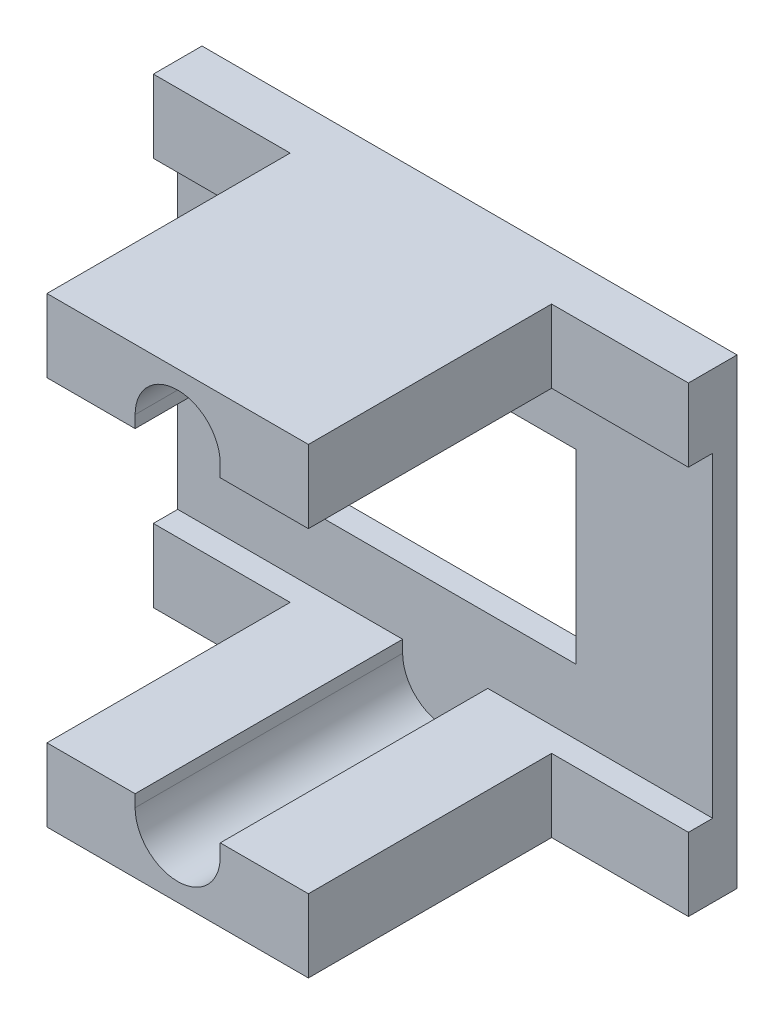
ISO-10303-21;
HEADER;
FILE_DESCRIPTION(('STEP AP214'),'2;1');
FILE_NAME('part.step','',(''),(''),'','','');
FILE_SCHEMA(('AUTOMOTIVE_DESIGN { 1 0 10303 214 1 1 1 1 }'));
ENDSEC;
DATA;
#1=APPLICATION_CONTEXT('core data for automotive mechanical design processes');
#2=APPLICATION_PROTOCOL_DEFINITION('international standard','automotive_design',2000,#1);
#3=PRODUCT_CONTEXT('',#1,'mechanical');
#4=PRODUCT('Part','Part','',(#3));
#5=PRODUCT_RELATED_PRODUCT_CATEGORY('part','',(#4));
#6=PRODUCT_DEFINITION_FORMATION('','',#4);
#7=PRODUCT_DEFINITION_CONTEXT('part definition',#1,'design');
#8=PRODUCT_DEFINITION('design','',#6,#7);
#9=PRODUCT_DEFINITION_SHAPE('','',#8);
#10=(LENGTH_UNIT() NAMED_UNIT(*) SI_UNIT(.MILLI.,.METRE.));
#11=(NAMED_UNIT(*) PLANE_ANGLE_UNIT() SI_UNIT($,.RADIAN.));
#12=(NAMED_UNIT(*) SI_UNIT($,.STERADIAN.) SOLID_ANGLE_UNIT());
#13=UNCERTAINTY_MEASURE_WITH_UNIT(LENGTH_MEASURE(1.E-05),#10,'distance_accuracy_value','');
#14=(GEOMETRIC_REPRESENTATION_CONTEXT(3) GLOBAL_UNCERTAINTY_ASSIGNED_CONTEXT((#13)) GLOBAL_UNIT_ASSIGNED_CONTEXT((#10,
#11,#12)) REPRESENTATION_CONTEXT('',''));
#15=CARTESIAN_POINT('',(0.,0.,0.));
#16=DIRECTION('',(0.,0.,1.));
#17=DIRECTION('',(1.,0.,0.));
#18=AXIS2_PLACEMENT_3D('',#15,#16,#17);
#19=CARTESIAN_POINT('',(-16.375,16.,12.));
#20=DIRECTION('',(0.,1.,0.));
#21=DIRECTION('',(0.,0.,1.));
#22=AXIS2_PLACEMENT_3D('',#19,#20,#21);
#23=PLANE('',#22);
#24=DIRECTION('',(0.,0.,1.));
#25=VECTOR('',#24,1.);
#26=CARTESIAN_POINT('',(-9.24999999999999,16.,12.));
#27=LINE('',#26,#25);
#28=CARTESIAN_POINT('',(-9.24999999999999,16.,1.));
#29=VERTEX_POINT('',#28);
#30=CARTESIAN_POINT('',(-9.24999999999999,16.,12.));
#31=VERTEX_POINT('',#30);
#32=EDGE_CURVE('E249',#29,#31,#27,.T.);
#33=ORIENTED_EDGE('',*,*,#32,.F.);
#34=DIRECTION('',(-1.,0.,0.));
#35=VECTOR('',#34,1.);
#36=CARTESIAN_POINT('',(-22.,16.,1.));
#37=LINE('',#36,#35);
#38=CARTESIAN_POINT('',(0.,16.,1.));
#39=VERTEX_POINT('',#38);
#40=EDGE_CURVE('E285',#39,#29,#37,.T.);
#41=ORIENTED_EDGE('',*,*,#40,.F.);
#42=DIRECTION('',(0.,0.,1.));
#43=VECTOR('',#42,1.);
#44=CARTESIAN_POINT('',(0.,16.,1.));
#45=LINE('',#44,#43);
#46=CARTESIAN_POINT('',(0.,16.,2.));
#47=VERTEX_POINT('',#46);
#48=EDGE_CURVE('E297',#39,#47,#45,.T.);
#49=ORIENTED_EDGE('',*,*,#48,.T.);
#50=DIRECTION('',(-1.,0.,0.));
#51=VECTOR('',#50,1.);
#52=CARTESIAN_POINT('',(-22.,16.,2.));
#53=LINE('',#52,#51);
#54=CARTESIAN_POINT('',(-5.625,16.,2.));
#55=VERTEX_POINT('',#54);
#56=EDGE_CURVE('E279',#47,#55,#53,.T.);
#57=ORIENTED_EDGE('',*,*,#56,.T.);
#58=DIRECTION('',(0.,0.,-1.));
#59=VECTOR('',#58,1.);
#60=CARTESIAN_POINT('',(-5.625,16.,12.));
#61=LINE('',#60,#59);
#62=CARTESIAN_POINT('',(-5.625,16.,12.));
#63=VERTEX_POINT('',#62);
#64=EDGE_CURVE('E365',#63,#55,#61,.T.);
#65=ORIENTED_EDGE('',*,*,#64,.F.);
#66=DIRECTION('',(1.,0.,0.));
#67=VECTOR('',#66,1.);
#68=CARTESIAN_POINT('',(-16.375,16.,12.));
#69=LINE('',#68,#67);
#70=EDGE_CURVE('E345',#31,#63,#69,.T.);
#71=ORIENTED_EDGE('',*,*,#70,.F.);
#72=EDGE_LOOP('',(#33,#41,#49,#57,#65,#71));
#73=FACE_BOUND('',#72,.T.);
#74=ADVANCED_FACE('F33',(#73),#23,.F.);
#75=CARTESIAN_POINT('',(0.,0.,12.));
#76=DIRECTION('',(0.,0.,1.));
#77=DIRECTION('',(1.,0.,0.));
#78=AXIS2_PLACEMENT_3D('',#75,#76,#77);
#79=PLANE('',#78);
#80=DIRECTION('',(0.,1.,0.));
#81=VECTOR('',#80,1.);
#82=CARTESIAN_POINT('',(-12.75,15.5,12.));
#83=LINE('',#82,#81);
#84=CARTESIAN_POINT('',(-12.75,16.,12.));
#85=VERTEX_POINT('',#84);
#86=CARTESIAN_POINT('',(-12.75,16.5,12.));
#87=VERTEX_POINT('',#86);
#88=EDGE_CURVE('E253',#85,#87,#83,.T.);
#89=ORIENTED_EDGE('',*,*,#88,.T.);
#90=CARTESIAN_POINT('',(-11.,16.5,12.));
#91=DIRECTION('',(0.,0.,1.));
#92=DIRECTION('',(1.,0.,0.));
#93=AXIS2_PLACEMENT_3D('',#90,#91,#92);
#94=CIRCLE('',#93,1.75);
#95=CARTESIAN_POINT('',(-9.24999999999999,16.5,12.));
#96=VERTEX_POINT('',#95);
#97=EDGE_CURVE('E256',#96,#87,#94,.T.);
#98=ORIENTED_EDGE('',*,*,#97,.F.);
#99=DIRECTION('',(0.,1.,0.));
#100=VECTOR('',#99,1.);
#101=CARTESIAN_POINT('',(-9.24999999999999,15.5,12.));
#102=LINE('',#101,#100);
#103=EDGE_CURVE('E255',#31,#96,#102,.T.);
#104=ORIENTED_EDGE('',*,*,#103,.F.);
#105=ORIENTED_EDGE('',*,*,#70,.T.);
#106=DIRECTION('',(0.,1.,0.));
#107=VECTOR('',#106,1.);
#108=CARTESIAN_POINT('',(-5.625,16.,12.));
#109=LINE('',#108,#107);
#110=CARTESIAN_POINT('',(-5.625,19.,12.));
#111=VERTEX_POINT('',#110);
#112=EDGE_CURVE('E344',#63,#111,#109,.T.);
#113=ORIENTED_EDGE('',*,*,#112,.T.);
#114=DIRECTION('',(-1.,0.,0.));
#115=VECTOR('',#114,1.);
#116=CARTESIAN_POINT('',(-16.375,19.,12.));
#117=LINE('',#116,#115);
#118=CARTESIAN_POINT('',(-16.375,19.,12.));
#119=VERTEX_POINT('',#118);
#120=EDGE_CURVE('E347',#111,#119,#117,.T.);
#121=ORIENTED_EDGE('',*,*,#120,.T.);
#122=DIRECTION('',(0.,-1.,0.));
#123=VECTOR('',#122,1.);
#124=CARTESIAN_POINT('',(-16.375,16.,12.));
#125=LINE('',#124,#123);
#126=CARTESIAN_POINT('',(-16.375,16.,12.));
#127=VERTEX_POINT('',#126);
#128=EDGE_CURVE('E349',#119,#127,#125,.T.);
#129=ORIENTED_EDGE('',*,*,#128,.T.);
#130=EDGE_CURVE('E341',#127,#85,#69,.T.);
#131=ORIENTED_EDGE('',*,*,#130,.T.);
#132=EDGE_LOOP('',(#89,#98,#104,#105,#113,#121,#129,#131));
#133=FACE_BOUND('',#132,.T.);
#134=ADVANCED_FACE('F472',(#133),#79,.T.);
#135=CARTESIAN_POINT('',(-16.375,3.,12.));
#136=DIRECTION('',(0.,-1.,0.));
#137=DIRECTION('',(0.,0.,-1.));
#138=AXIS2_PLACEMENT_3D('',#135,#136,#137);
#139=PLANE('',#138);
#140=DIRECTION('',(0.,0.,1.));
#141=VECTOR('',#140,1.);
#142=CARTESIAN_POINT('',(-12.75,3.,12.));
#143=LINE('',#142,#141);
#144=CARTESIAN_POINT('',(-12.75,3.,1.));
#145=VERTEX_POINT('',#144);
#146=CARTESIAN_POINT('',(-12.75,3.,12.));
#147=VERTEX_POINT('',#146);
#148=EDGE_CURVE('E272',#145,#147,#143,.T.);
#149=ORIENTED_EDGE('',*,*,#148,.F.);
#150=DIRECTION('',(1.,0.,0.));
#151=VECTOR('',#150,1.);
#152=CARTESIAN_POINT('',(-22.,3.,1.));
#153=LINE('',#152,#151);
#154=CARTESIAN_POINT('',(-22.,3.,1.));
#155=VERTEX_POINT('',#154);
#156=EDGE_CURVE('E280',#155,#145,#153,.T.);
#157=ORIENTED_EDGE('',*,*,#156,.F.);
#158=DIRECTION('',(0.,0.,1.));
#159=VECTOR('',#158,1.);
#160=CARTESIAN_POINT('',(-22.,3.,1.));
#161=LINE('',#160,#159);
#162=CARTESIAN_POINT('',(-22.,3.,2.));
#163=VERTEX_POINT('',#162);
#164=EDGE_CURVE('E288',#155,#163,#161,.T.);
#165=ORIENTED_EDGE('',*,*,#164,.T.);
#166=DIRECTION('',(1.,0.,0.));
#167=VECTOR('',#166,1.);
#168=CARTESIAN_POINT('',(-22.,3.,2.));
#169=LINE('',#168,#167);
#170=CARTESIAN_POINT('',(-16.375,3.,2.));
#171=VERTEX_POINT('',#170);
#172=EDGE_CURVE('E289',#163,#171,#169,.T.);
#173=ORIENTED_EDGE('',*,*,#172,.T.);
#174=DIRECTION('',(0.,0.,-1.));
#175=VECTOR('',#174,1.);
#176=CARTESIAN_POINT('',(-16.375,3.,12.));
#177=LINE('',#176,#175);
#178=CARTESIAN_POINT('',(-16.375,3.,12.));
#179=VERTEX_POINT('',#178);
#180=EDGE_CURVE('E324',#179,#171,#177,.T.);
#181=ORIENTED_EDGE('',*,*,#180,.F.);
#182=DIRECTION('',(-1.,0.,0.));
#183=VECTOR('',#182,1.);
#184=CARTESIAN_POINT('',(-16.375,3.,12.));
#185=LINE('',#184,#183);
#186=EDGE_CURVE('E320',#147,#179,#185,.T.);
#187=ORIENTED_EDGE('',*,*,#186,.F.);
#188=EDGE_LOOP('',(#149,#157,#165,#173,#181,#187));
#189=FACE_BOUND('',#188,.T.);
#190=ADVANCED_FACE('F452',(#189),#139,.F.);
#191=CARTESIAN_POINT('',(0.,0.,12.));
#192=DIRECTION('',(0.,0.,1.));
#193=DIRECTION('',(1.,0.,0.));
#194=AXIS2_PLACEMENT_3D('',#191,#192,#193);
#195=PLANE('',#194);
#196=CARTESIAN_POINT('',(-11.,2.5,12.));
#197=DIRECTION('',(0.,0.,1.));
#198=DIRECTION('',(1.,0.,0.));
#199=AXIS2_PLACEMENT_3D('',#196,#197,#198);
#200=CIRCLE('',#199,1.75);
#201=CARTESIAN_POINT('',(-12.75,2.5,12.));
#202=VERTEX_POINT('',#201);
#203=CARTESIAN_POINT('',(-9.25,2.5,12.));
#204=VERTEX_POINT('',#203);
#205=EDGE_CURVE('E56',#202,#204,#200,.T.);
#206=ORIENTED_EDGE('',*,*,#205,.F.);
#207=DIRECTION('',(0.,-1.,0.));
#208=VECTOR('',#207,1.);
#209=CARTESIAN_POINT('',(-12.75,0.,12.));
#210=LINE('',#209,#208);
#211=EDGE_CURVE('E226',#147,#202,#210,.T.);
#212=ORIENTED_EDGE('',*,*,#211,.F.);
#213=ORIENTED_EDGE('',*,*,#186,.T.);
#214=DIRECTION('',(0.,-1.,0.));
#215=VECTOR('',#214,1.);
#216=CARTESIAN_POINT('',(-16.375,3.,12.));
#217=LINE('',#216,#215);
#218=CARTESIAN_POINT('',(-16.375,0.,12.));
#219=VERTEX_POINT('',#218);
#220=EDGE_CURVE('E312',#179,#219,#217,.T.);
#221=ORIENTED_EDGE('',*,*,#220,.T.);
#222=DIRECTION('',(1.,0.,0.));
#223=VECTOR('',#222,1.);
#224=CARTESIAN_POINT('',(-16.375,0.,12.));
#225=LINE('',#224,#223);
#226=CARTESIAN_POINT('',(-5.625,0.,12.));
#227=VERTEX_POINT('',#226);
#228=EDGE_CURVE('E315',#219,#227,#225,.T.);
#229=ORIENTED_EDGE('',*,*,#228,.T.);
#230=DIRECTION('',(0.,1.,0.));
#231=VECTOR('',#230,1.);
#232=CARTESIAN_POINT('',(-5.625,3.,12.));
#233=LINE('',#232,#231);
#234=CARTESIAN_POINT('',(-5.625,3.,12.));
#235=VERTEX_POINT('',#234);
#236=EDGE_CURVE('E318',#227,#235,#233,.T.);
#237=ORIENTED_EDGE('',*,*,#236,.T.);
#238=CARTESIAN_POINT('',(-9.25,3.,12.));
#239=VERTEX_POINT('',#238);
#240=EDGE_CURVE('E321',#235,#239,#185,.T.);
#241=ORIENTED_EDGE('',*,*,#240,.T.);
#242=DIRECTION('',(0.,-1.,0.));
#243=VECTOR('',#242,1.);
#244=CARTESIAN_POINT('',(-9.25,0.,12.));
#245=LINE('',#244,#243);
#246=EDGE_CURVE('E227',#239,#204,#245,.T.);
#247=ORIENTED_EDGE('',*,*,#246,.T.);
#248=EDGE_LOOP('',(#206,#212,#213,#221,#229,#237,#241,#247));
#249=FACE_BOUND('',#248,.T.);
#250=ADVANCED_FACE('F502',(#249),#195,.T.);
#251=CARTESIAN_POINT('',(0.,0.,2.));
#252=DIRECTION('',(0.,0.,1.));
#253=DIRECTION('',(1.,0.,0.));
#254=AXIS2_PLACEMENT_3D('',#251,#252,#253);
#255=PLANE('',#254);
#256=ORIENTED_EDGE('',*,*,#56,.F.);
#257=DIRECTION('',(0.,1.,0.));
#258=VECTOR('',#257,1.);
#259=CARTESIAN_POINT('',(0.,0.,2.));
#260=LINE('',#259,#258);
#261=CARTESIAN_POINT('',(0.,19.,2.));
#262=VERTEX_POINT('',#261);
#263=EDGE_CURVE('E393',#47,#262,#260,.T.);
#264=ORIENTED_EDGE('',*,*,#263,.T.);
#265=DIRECTION('',(-1.,0.,0.));
#266=VECTOR('',#265,1.);
#267=CARTESIAN_POINT('',(0.,19.,2.));
#268=LINE('',#267,#266);
#269=CARTESIAN_POINT('',(-5.625,19.,2.));
#270=VERTEX_POINT('',#269);
#271=EDGE_CURVE('E394',#262,#270,#268,.T.);
#272=ORIENTED_EDGE('',*,*,#271,.T.);
#273=DIRECTION('',(0.,1.,0.));
#274=VECTOR('',#273,1.);
#275=CARTESIAN_POINT('',(-5.625,16.,2.));
#276=LINE('',#275,#274);
#277=EDGE_CURVE('E340',#55,#270,#276,.T.);
#278=ORIENTED_EDGE('',*,*,#277,.F.);
#279=EDGE_LOOP('',(#256,#264,#272,#278));
#280=FACE_BOUND('',#279,.T.);
#281=ADVANCED_FACE('F481',(#280),#255,.T.);
#282=CARTESIAN_POINT('',(-16.375,16.,2.));
#283=VERTEX_POINT('',#282);
#284=CARTESIAN_POINT('',(-22.,16.,2.));
#285=VERTEX_POINT('',#284);
#286=EDGE_CURVE('E291',#283,#285,#53,.T.);
#287=ORIENTED_EDGE('',*,*,#286,.F.);
#288=DIRECTION('',(0.,-1.,0.));
#289=VECTOR('',#288,1.);
#290=CARTESIAN_POINT('',(-16.375,16.,2.));
#291=LINE('',#290,#289);
#292=CARTESIAN_POINT('',(-16.375,19.,2.));
#293=VERTEX_POINT('',#292);
#294=EDGE_CURVE('E354',#293,#283,#291,.T.);
#295=ORIENTED_EDGE('',*,*,#294,.F.);
#296=CARTESIAN_POINT('',(-22.,19.,2.));
#297=VERTEX_POINT('',#296);
#298=EDGE_CURVE('E392',#293,#297,#268,.T.);
#299=ORIENTED_EDGE('',*,*,#298,.T.);
#300=DIRECTION('',(0.,-1.,0.));
#301=VECTOR('',#300,1.);
#302=CARTESIAN_POINT('',(-22.,0.,2.));
#303=LINE('',#302,#301);
#304=EDGE_CURVE('E397',#297,#285,#303,.T.);
#305=ORIENTED_EDGE('',*,*,#304,.T.);
#306=EDGE_LOOP('',(#287,#295,#299,#305));
#307=FACE_BOUND('',#306,.T.);
#308=ADVANCED_FACE('F462',(#307),#255,.T.);
#309=ORIENTED_EDGE('',*,*,#172,.F.);
#310=CARTESIAN_POINT('',(-22.,0.,2.));
#311=VERTEX_POINT('',#310);
#312=EDGE_CURVE('E396',#163,#311,#303,.T.);
#313=ORIENTED_EDGE('',*,*,#312,.T.);
#314=DIRECTION('',(1.,0.,0.));
#315=VECTOR('',#314,1.);
#316=CARTESIAN_POINT('',(0.,0.,2.));
#317=LINE('',#316,#315);
#318=CARTESIAN_POINT('',(-16.375,0.,2.));
#319=VERTEX_POINT('',#318);
#320=EDGE_CURVE('E401',#311,#319,#317,.T.);
#321=ORIENTED_EDGE('',*,*,#320,.T.);
#322=DIRECTION('',(0.,-1.,0.));
#323=VECTOR('',#322,1.);
#324=CARTESIAN_POINT('',(-16.375,3.,2.));
#325=LINE('',#324,#323);
#326=EDGE_CURVE('E311',#171,#319,#325,.T.);
#327=ORIENTED_EDGE('',*,*,#326,.F.);
#328=EDGE_LOOP('',(#309,#313,#321,#327));
#329=FACE_BOUND('',#328,.T.);
#330=ADVANCED_FACE('F448',(#329),#255,.T.);
#331=CARTESIAN_POINT('',(-5.625,13.325,2.));
#332=DIRECTION('',(-1.,0.,0.));
#333=DIRECTION('',(0.,0.,1.));
#334=AXIS2_PLACEMENT_3D('',#331,#332,#333);
#335=PLANE('',#334);
#336=DIRECTION('',(0.,0.,-1.));
#337=VECTOR('',#336,1.);
#338=CARTESIAN_POINT('',(-5.625,5.675,2.));
#339=LINE('',#338,#337);
#340=CARTESIAN_POINT('',(-5.625,5.675,1.));
#341=VERTEX_POINT('',#340);
#342=CARTESIAN_POINT('',(-5.625,5.675,0.));
#343=VERTEX_POINT('',#342);
#344=EDGE_CURVE('E380',#341,#343,#339,.T.);
#345=ORIENTED_EDGE('',*,*,#344,.F.);
#346=DIRECTION('',(0.,1.,0.));
#347=VECTOR('',#346,1.);
#348=CARTESIAN_POINT('',(-5.625,13.325,1.));
#349=LINE('',#348,#347);
#350=CARTESIAN_POINT('',(-5.625,13.325,1.));
#351=VERTEX_POINT('',#350);
#352=EDGE_CURVE('E308',#341,#351,#349,.T.);
#353=ORIENTED_EDGE('',*,*,#352,.T.);
#354=DIRECTION('',(0.,0.,-1.));
#355=VECTOR('',#354,1.);
#356=CARTESIAN_POINT('',(-5.625,13.325,2.));
#357=LINE('',#356,#355);
#358=CARTESIAN_POINT('',(-5.625,13.325,0.));
#359=VERTEX_POINT('',#358);
#360=EDGE_CURVE('E386',#351,#359,#357,.T.);
#361=ORIENTED_EDGE('',*,*,#360,.T.);
#362=DIRECTION('',(0.,1.,0.));
#363=VECTOR('',#362,1.);
#364=CARTESIAN_POINT('',(-5.625,13.325,0.));
#365=LINE('',#364,#363);
#366=EDGE_CURVE('E368',#343,#359,#365,.T.);
#367=ORIENTED_EDGE('',*,*,#366,.F.);
#368=EDGE_LOOP('',(#345,#353,#361,#367));
#369=FACE_BOUND('',#368,.T.);
#370=ADVANCED_FACE('F554',(#369),#335,.T.);
#371=CARTESIAN_POINT('',(-16.375,13.325,2.));
#372=DIRECTION('',(0.,-1.,0.));
#373=DIRECTION('',(0.,0.,-1.));
#374=AXIS2_PLACEMENT_3D('',#371,#372,#373);
#375=PLANE('',#374);
#376=ORIENTED_EDGE('',*,*,#360,.F.);
#377=DIRECTION('',(-1.,0.,0.));
#378=VECTOR('',#377,1.);
#379=CARTESIAN_POINT('',(-16.375,13.325,1.));
#380=LINE('',#379,#378);
#381=CARTESIAN_POINT('',(-16.375,13.325,1.));
#382=VERTEX_POINT('',#381);
#383=EDGE_CURVE('E305',#351,#382,#380,.T.);
#384=ORIENTED_EDGE('',*,*,#383,.T.);
#385=DIRECTION('',(0.,0.,-1.));
#386=VECTOR('',#385,1.);
#387=CARTESIAN_POINT('',(-16.375,13.325,2.));
#388=LINE('',#387,#386);
#389=CARTESIAN_POINT('',(-16.375,13.325,0.));
#390=VERTEX_POINT('',#389);
#391=EDGE_CURVE('E384',#382,#390,#388,.T.);
#392=ORIENTED_EDGE('',*,*,#391,.T.);
#393=DIRECTION('',(-1.,0.,0.));
#394=VECTOR('',#393,1.);
#395=CARTESIAN_POINT('',(-16.375,13.325,0.));
#396=LINE('',#395,#394);
#397=EDGE_CURVE('E371',#359,#390,#396,.T.);
#398=ORIENTED_EDGE('',*,*,#397,.F.);
#399=EDGE_LOOP('',(#376,#384,#392,#398));
#400=FACE_BOUND('',#399,.T.);
#401=ADVANCED_FACE('F559',(#400),#375,.T.);
#402=CARTESIAN_POINT('',(-16.375,13.325,2.));
#403=DIRECTION('',(1.,0.,0.));
#404=DIRECTION('',(0.,0.,-1.));
#405=AXIS2_PLACEMENT_3D('',#402,#403,#404);
#406=PLANE('',#405);
#407=ORIENTED_EDGE('',*,*,#391,.F.);
#408=DIRECTION('',(0.,-1.,0.));
#409=VECTOR('',#408,1.);
#410=CARTESIAN_POINT('',(-16.375,13.325,1.));
#411=LINE('',#410,#409);
#412=CARTESIAN_POINT('',(-16.375,5.675,1.));
#413=VERTEX_POINT('',#412);
#414=EDGE_CURVE('E296',#382,#413,#411,.T.);
#415=ORIENTED_EDGE('',*,*,#414,.T.);
#416=DIRECTION('',(0.,0.,-1.));
#417=VECTOR('',#416,1.);
#418=CARTESIAN_POINT('',(-16.375,5.675,2.));
#419=LINE('',#418,#417);
#420=CARTESIAN_POINT('',(-16.375,5.675,0.));
#421=VERTEX_POINT('',#420);
#422=EDGE_CURVE('E382',#413,#421,#419,.T.);
#423=ORIENTED_EDGE('',*,*,#422,.T.);
#424=DIRECTION('',(0.,-1.,0.));
#425=VECTOR('',#424,1.);
#426=CARTESIAN_POINT('',(-16.375,13.325,0.));
#427=LINE('',#426,#425);
#428=EDGE_CURVE('E374',#390,#421,#427,.T.);
#429=ORIENTED_EDGE('',*,*,#428,.F.);
#430=EDGE_LOOP('',(#407,#415,#423,#429));
#431=FACE_BOUND('',#430,.T.);
#432=ADVANCED_FACE('F549',(#431),#406,.T.);
#433=CARTESIAN_POINT('',(-16.375,5.675,2.));
#434=DIRECTION('',(0.,1.,0.));
#435=DIRECTION('',(0.,0.,1.));
#436=AXIS2_PLACEMENT_3D('',#433,#434,#435);
#437=PLANE('',#436);
#438=ORIENTED_EDGE('',*,*,#422,.F.);
#439=DIRECTION('',(1.,0.,0.));
#440=VECTOR('',#439,1.);
#441=CARTESIAN_POINT('',(-16.375,5.675,1.));
#442=LINE('',#441,#440);
#443=EDGE_CURVE('E11',#413,#341,#442,.T.);
#444=ORIENTED_EDGE('',*,*,#443,.T.);
#445=ORIENTED_EDGE('',*,*,#344,.T.);
#446=DIRECTION('',(1.,0.,0.));
#447=VECTOR('',#446,1.);
#448=CARTESIAN_POINT('',(-16.375,5.675,0.));
#449=LINE('',#448,#447);
#450=EDGE_CURVE('E377',#421,#343,#449,.T.);
#451=ORIENTED_EDGE('',*,*,#450,.F.);
#452=EDGE_LOOP('',(#438,#444,#445,#451));
#453=FACE_BOUND('',#452,.T.);
#454=ADVANCED_FACE('F545',(#453),#437,.T.);
#455=CARTESIAN_POINT('',(-5.625,3.,2.));
#456=VERTEX_POINT('',#455);
#457=CARTESIAN_POINT('',(0.,3.,2.));
#458=VERTEX_POINT('',#457);
#459=EDGE_CURVE('E274',#456,#458,#169,.T.);
#460=ORIENTED_EDGE('',*,*,#459,.F.);
#461=DIRECTION('',(0.,1.,0.));
#462=VECTOR('',#461,1.);
#463=CARTESIAN_POINT('',(-5.625,3.,2.));
#464=LINE('',#463,#462);
#465=CARTESIAN_POINT('',(-5.625,0.,2.));
#466=VERTEX_POINT('',#465);
#467=EDGE_CURVE('E316',#466,#456,#464,.T.);
#468=ORIENTED_EDGE('',*,*,#467,.F.);
#469=CARTESIAN_POINT('',(0.,0.,2.));
#470=VERTEX_POINT('',#469);
#471=EDGE_CURVE('E400',#466,#470,#317,.T.);
#472=ORIENTED_EDGE('',*,*,#471,.T.);
#473=EDGE_CURVE('E389',#470,#458,#260,.T.);
#474=ORIENTED_EDGE('',*,*,#473,.T.);
#475=EDGE_LOOP('',(#460,#468,#472,#474));
#476=FACE_BOUND('',#475,.T.);
#477=ADVANCED_FACE('F493',(#476),#255,.T.);
#478=CARTESIAN_POINT('',(0.,0.,0.));
#479=DIRECTION('',(0.,0.,1.));
#480=DIRECTION('',(1.,0.,0.));
#481=AXIS2_PLACEMENT_3D('',#478,#479,#480);
#482=PLANE('',#481);
#483=DIRECTION('',(0.,1.,0.));
#484=VECTOR('',#483,1.);
#485=CARTESIAN_POINT('',(0.,0.,0.));
#486=LINE('',#485,#484);
#487=CARTESIAN_POINT('',(0.,0.,0.));
#488=VERTEX_POINT('',#487);
#489=CARTESIAN_POINT('',(0.,19.,0.));
#490=VERTEX_POINT('',#489);
#491=EDGE_CURVE('E388',#488,#490,#486,.T.);
#492=ORIENTED_EDGE('',*,*,#491,.F.);
#493=DIRECTION('',(1.,0.,0.));
#494=VECTOR('',#493,1.);
#495=CARTESIAN_POINT('',(0.,0.,0.));
#496=LINE('',#495,#494);
#497=CARTESIAN_POINT('',(-22.,0.,0.));
#498=VERTEX_POINT('',#497);
#499=EDGE_CURVE('E410',#498,#488,#496,.T.);
#500=ORIENTED_EDGE('',*,*,#499,.F.);
#501=DIRECTION('',(0.,-1.,0.));
#502=VECTOR('',#501,1.);
#503=CARTESIAN_POINT('',(-22.,0.,0.));
#504=LINE('',#503,#502);
#505=CARTESIAN_POINT('',(-22.,19.,0.));
#506=VERTEX_POINT('',#505);
#507=EDGE_CURVE('E408',#506,#498,#504,.T.);
#508=ORIENTED_EDGE('',*,*,#507,.F.);
#509=DIRECTION('',(-1.,0.,0.));
#510=VECTOR('',#509,1.);
#511=CARTESIAN_POINT('',(0.,19.,0.));
#512=LINE('',#511,#510);
#513=EDGE_CURVE('E406',#490,#506,#512,.T.);
#514=ORIENTED_EDGE('',*,*,#513,.F.);
#515=EDGE_LOOP('',(#492,#500,#508,#514));
#516=FACE_BOUND('',#515,.T.);
#517=ORIENTED_EDGE('',*,*,#366,.T.);
#518=ORIENTED_EDGE('',*,*,#397,.T.);
#519=ORIENTED_EDGE('',*,*,#428,.T.);
#520=ORIENTED_EDGE('',*,*,#450,.T.);
#521=EDGE_LOOP('',(#517,#518,#519,#520));
#522=FACE_BOUND('',#521,.T.);
#523=ADVANCED_FACE('F432',(#516,#522),#482,.F.);
#524=CARTESIAN_POINT('',(0.,0.,2.));
#525=DIRECTION('',(-1.,0.,0.));
#526=DIRECTION('',(0.,0.,1.));
#527=AXIS2_PLACEMENT_3D('',#524,#525,#526);
#528=PLANE('',#527);
#529=ORIENTED_EDGE('',*,*,#263,.F.);
#530=ORIENTED_EDGE('',*,*,#48,.F.);
#531=DIRECTION('',(0.,1.,0.));
#532=VECTOR('',#531,1.);
#533=CARTESIAN_POINT('',(0.,16.,1.));
#534=LINE('',#533,#532);
#535=CARTESIAN_POINT('',(0.,3.,1.));
#536=VERTEX_POINT('',#535);
#537=EDGE_CURVE('E282',#536,#39,#534,.T.);
#538=ORIENTED_EDGE('',*,*,#537,.F.);
#539=DIRECTION('',(0.,0.,1.));
#540=VECTOR('',#539,1.);
#541=CARTESIAN_POINT('',(0.,3.,1.));
#542=LINE('',#541,#540);
#543=EDGE_CURVE('E299',#536,#458,#542,.T.);
#544=ORIENTED_EDGE('',*,*,#543,.T.);
#545=ORIENTED_EDGE('',*,*,#473,.F.);
#546=DIRECTION('',(0.,0.,-1.));
#547=VECTOR('',#546,1.);
#548=CARTESIAN_POINT('',(0.,0.,2.));
#549=LINE('',#548,#547);
#550=EDGE_CURVE('E403',#470,#488,#549,.T.);
#551=ORIENTED_EDGE('',*,*,#550,.T.);
#552=ORIENTED_EDGE('',*,*,#491,.T.);
#553=DIRECTION('',(0.,0.,-1.));
#554=VECTOR('',#553,1.);
#555=CARTESIAN_POINT('',(0.,19.,2.));
#556=LINE('',#555,#554);
#557=EDGE_CURVE('E41',#262,#490,#556,.T.);
#558=ORIENTED_EDGE('',*,*,#557,.F.);
#559=EDGE_LOOP('',(#529,#530,#538,#544,#545,#551,#552,#558));
#560=FACE_BOUND('',#559,.T.);
#561=ADVANCED_FACE('F35',(#560),#528,.F.);
#562=CARTESIAN_POINT('',(0.,19.,2.));
#563=DIRECTION('',(0.,-1.,0.));
#564=DIRECTION('',(0.,0.,-1.));
#565=AXIS2_PLACEMENT_3D('',#562,#563,#564);
#566=PLANE('',#565);
#567=ORIENTED_EDGE('',*,*,#513,.T.);
#568=DIRECTION('',(0.,0.,-1.));
#569=VECTOR('',#568,1.);
#570=CARTESIAN_POINT('',(-22.,19.,2.));
#571=LINE('',#570,#569);
#572=EDGE_CURVE('E417',#297,#506,#571,.T.);
#573=ORIENTED_EDGE('',*,*,#572,.F.);
#574=ORIENTED_EDGE('',*,*,#298,.F.);
#575=DIRECTION('',(0.,0.,-1.));
#576=VECTOR('',#575,1.);
#577=CARTESIAN_POINT('',(-16.375,19.,12.));
#578=LINE('',#577,#576);
#579=EDGE_CURVE('E359',#119,#293,#578,.T.);
#580=ORIENTED_EDGE('',*,*,#579,.F.);
#581=ORIENTED_EDGE('',*,*,#120,.F.);
#582=DIRECTION('',(0.,0.,-1.));
#583=VECTOR('',#582,1.);
#584=CARTESIAN_POINT('',(-5.625,19.,12.));
#585=LINE('',#584,#583);
#586=EDGE_CURVE('E362',#111,#270,#585,.T.);
#587=ORIENTED_EDGE('',*,*,#586,.T.);
#588=ORIENTED_EDGE('',*,*,#271,.F.);
#589=ORIENTED_EDGE('',*,*,#557,.T.);
#590=EDGE_LOOP('',(#567,#573,#574,#580,#581,#587,#588,#589));
#591=FACE_BOUND('',#590,.T.);
#592=ADVANCED_FACE('F423',(#591),#566,.F.);
#593=CARTESIAN_POINT('',(-22.,0.,2.));
#594=DIRECTION('',(1.,0.,0.));
#595=DIRECTION('',(0.,0.,-1.));
#596=AXIS2_PLACEMENT_3D('',#593,#594,#595);
#597=PLANE('',#596);
#598=DIRECTION('',(0.,-1.,0.));
#599=VECTOR('',#598,1.);
#600=CARTESIAN_POINT('',(-22.,16.,1.));
#601=LINE('',#600,#599);
#602=CARTESIAN_POINT('',(-22.,16.,1.));
#603=VERTEX_POINT('',#602);
#604=EDGE_CURVE('E275',#603,#155,#601,.T.);
#605=ORIENTED_EDGE('',*,*,#604,.F.);
#606=DIRECTION('',(0.,0.,1.));
#607=VECTOR('',#606,1.);
#608=CARTESIAN_POINT('',(-22.,16.,1.));
#609=LINE('',#608,#607);
#610=EDGE_CURVE('E293',#603,#285,#609,.T.);
#611=ORIENTED_EDGE('',*,*,#610,.T.);
#612=ORIENTED_EDGE('',*,*,#304,.F.);
#613=ORIENTED_EDGE('',*,*,#572,.T.);
#614=ORIENTED_EDGE('',*,*,#507,.T.);
#615=DIRECTION('',(0.,0.,-1.));
#616=VECTOR('',#615,1.);
#617=CARTESIAN_POINT('',(-22.,0.,2.));
#618=LINE('',#617,#616);
#619=EDGE_CURVE('E414',#311,#498,#618,.T.);
#620=ORIENTED_EDGE('',*,*,#619,.F.);
#621=ORIENTED_EDGE('',*,*,#312,.F.);
#622=ORIENTED_EDGE('',*,*,#164,.F.);
#623=EDGE_LOOP('',(#605,#611,#612,#613,#614,#620,#621,#622));
#624=FACE_BOUND('',#623,.T.);
#625=ADVANCED_FACE('F438',(#624),#597,.F.);
#626=CARTESIAN_POINT('',(0.,0.,2.));
#627=DIRECTION('',(0.,1.,0.));
#628=DIRECTION('',(-1.,0.,0.));
#629=AXIS2_PLACEMENT_3D('',#626,#627,#628);
#630=PLANE('',#629);
#631=ORIENTED_EDGE('',*,*,#499,.T.);
#632=ORIENTED_EDGE('',*,*,#550,.F.);
#633=ORIENTED_EDGE('',*,*,#471,.F.);
#634=DIRECTION('',(0.,0.,-1.));
#635=VECTOR('',#634,1.);
#636=CARTESIAN_POINT('',(-5.625,0.,12.));
#637=LINE('',#636,#635);
#638=EDGE_CURVE('E334',#227,#466,#637,.T.);
#639=ORIENTED_EDGE('',*,*,#638,.F.);
#640=ORIENTED_EDGE('',*,*,#228,.F.);
#641=DIRECTION('',(0.,0.,-1.));
#642=VECTOR('',#641,1.);
#643=CARTESIAN_POINT('',(-16.375,0.,12.));
#644=LINE('',#643,#642);
#645=EDGE_CURVE('E337',#219,#319,#644,.T.);
#646=ORIENTED_EDGE('',*,*,#645,.T.);
#647=ORIENTED_EDGE('',*,*,#320,.F.);
#648=ORIENTED_EDGE('',*,*,#619,.T.);
#649=EDGE_LOOP('',(#631,#632,#633,#639,#640,#646,#647,#648));
#650=FACE_BOUND('',#649,.T.);
#651=ADVANCED_FACE('F443',(#650),#630,.F.);
#652=CARTESIAN_POINT('',(-12.75,16.,1.));
#653=VERTEX_POINT('',#652);
#654=EDGE_CURVE('E284',#653,#603,#37,.T.);
#655=ORIENTED_EDGE('',*,*,#654,.F.);
#656=DIRECTION('',(0.,0.,1.));
#657=VECTOR('',#656,1.);
#658=CARTESIAN_POINT('',(-12.75,16.,12.));
#659=LINE('',#658,#657);
#660=EDGE_CURVE('E268',#653,#85,#659,.T.);
#661=ORIENTED_EDGE('',*,*,#660,.T.);
#662=ORIENTED_EDGE('',*,*,#130,.F.);
#663=DIRECTION('',(0.,0.,-1.));
#664=VECTOR('',#663,1.);
#665=CARTESIAN_POINT('',(-16.375,16.,12.));
#666=LINE('',#665,#664);
#667=EDGE_CURVE('E351',#127,#283,#666,.T.);
#668=ORIENTED_EDGE('',*,*,#667,.T.);
#669=ORIENTED_EDGE('',*,*,#286,.T.);
#670=ORIENTED_EDGE('',*,*,#610,.F.);
#671=EDGE_LOOP('',(#655,#661,#662,#668,#669,#670));
#672=FACE_BOUND('',#671,.T.);
#673=ADVANCED_FACE('F460',(#672),#23,.F.);
#674=CARTESIAN_POINT('',(-5.625,16.,12.));
#675=DIRECTION('',(-1.,0.,0.));
#676=DIRECTION('',(0.,0.,1.));
#677=AXIS2_PLACEMENT_3D('',#674,#675,#676);
#678=PLANE('',#677);
#679=ORIENTED_EDGE('',*,*,#277,.T.);
#680=ORIENTED_EDGE('',*,*,#586,.F.);
#681=ORIENTED_EDGE('',*,*,#112,.F.);
#682=ORIENTED_EDGE('',*,*,#64,.T.);
#683=EDGE_LOOP('',(#679,#680,#681,#682));
#684=FACE_BOUND('',#683,.T.);
#685=ADVANCED_FACE('F476',(#684),#678,.F.);
#686=CARTESIAN_POINT('',(-16.375,16.,12.));
#687=DIRECTION('',(1.,0.,0.));
#688=DIRECTION('',(0.,0.,-1.));
#689=AXIS2_PLACEMENT_3D('',#686,#687,#688);
#690=PLANE('',#689);
#691=ORIENTED_EDGE('',*,*,#294,.T.);
#692=ORIENTED_EDGE('',*,*,#667,.F.);
#693=ORIENTED_EDGE('',*,*,#128,.F.);
#694=ORIENTED_EDGE('',*,*,#579,.T.);
#695=EDGE_LOOP('',(#691,#692,#693,#694));
#696=FACE_BOUND('',#695,.T.);
#697=ADVANCED_FACE('F468',(#696),#690,.F.);
#698=CARTESIAN_POINT('',(-16.375,3.,12.));
#699=DIRECTION('',(1.,0.,0.));
#700=DIRECTION('',(0.,0.,-1.));
#701=AXIS2_PLACEMENT_3D('',#698,#699,#700);
#702=PLANE('',#701);
#703=ORIENTED_EDGE('',*,*,#326,.T.);
#704=ORIENTED_EDGE('',*,*,#645,.F.);
#705=ORIENTED_EDGE('',*,*,#220,.F.);
#706=ORIENTED_EDGE('',*,*,#180,.T.);
#707=EDGE_LOOP('',(#703,#704,#705,#706));
#708=FACE_BOUND('',#707,.T.);
#709=ADVANCED_FACE('F506',(#708),#702,.F.);
#710=CARTESIAN_POINT('',(-5.625,3.,12.));
#711=DIRECTION('',(-1.,0.,0.));
#712=DIRECTION('',(0.,-1.,0.));
#713=AXIS2_PLACEMENT_3D('',#710,#711,#712);
#714=PLANE('',#713);
#715=ORIENTED_EDGE('',*,*,#467,.T.);
#716=DIRECTION('',(0.,0.,-1.));
#717=VECTOR('',#716,1.);
#718=CARTESIAN_POINT('',(-5.625,3.,12.));
#719=LINE('',#718,#717);
#720=EDGE_CURVE('E331',#235,#456,#719,.T.);
#721=ORIENTED_EDGE('',*,*,#720,.F.);
#722=ORIENTED_EDGE('',*,*,#236,.F.);
#723=ORIENTED_EDGE('',*,*,#638,.T.);
#724=EDGE_LOOP('',(#715,#721,#722,#723));
#725=FACE_BOUND('',#724,.T.);
#726=ADVANCED_FACE('F499',(#725),#714,.F.);
#727=CARTESIAN_POINT('',(-9.25,3.,1.));
#728=VERTEX_POINT('',#727);
#729=EDGE_CURVE('E278',#728,#536,#153,.T.);
#730=ORIENTED_EDGE('',*,*,#729,.F.);
#731=DIRECTION('',(0.,0.,1.));
#732=VECTOR('',#731,1.);
#733=CARTESIAN_POINT('',(-9.25,3.,12.));
#734=LINE('',#733,#732);
#735=EDGE_CURVE('E233',#728,#239,#734,.T.);
#736=ORIENTED_EDGE('',*,*,#735,.T.);
#737=ORIENTED_EDGE('',*,*,#240,.F.);
#738=ORIENTED_EDGE('',*,*,#720,.T.);
#739=ORIENTED_EDGE('',*,*,#459,.T.);
#740=ORIENTED_EDGE('',*,*,#543,.F.);
#741=EDGE_LOOP('',(#730,#736,#737,#738,#739,#740));
#742=FACE_BOUND('',#741,.T.);
#743=ADVANCED_FACE('F491',(#742),#139,.F.);
#744=CARTESIAN_POINT('',(0.,0.,1.));
#745=DIRECTION('',(0.,0.,1.));
#746=DIRECTION('',(1.,0.,0.));
#747=AXIS2_PLACEMENT_3D('',#744,#745,#746);
#748=PLANE('',#747);
#749=ORIENTED_EDGE('',*,*,#156,.T.);
#750=DIRECTION('',(0.,1.,0.));
#751=VECTOR('',#750,1.);
#752=CARTESIAN_POINT('',(-12.75,0.,1.));
#753=LINE('',#752,#751);
#754=CARTESIAN_POINT('',(-12.75,2.5,1.));
#755=VERTEX_POINT('',#754);
#756=EDGE_CURVE('E236',#755,#145,#753,.T.);
#757=ORIENTED_EDGE('',*,*,#756,.F.);
#758=CARTESIAN_POINT('',(-11.,2.5,1.));
#759=DIRECTION('',(0.,0.,1.));
#760=DIRECTION('',(1.,0.,0.));
#761=AXIS2_PLACEMENT_3D('',#758,#759,#760);
#762=CIRCLE('',#761,1.75);
#763=CARTESIAN_POINT('',(-9.25,2.5,1.));
#764=VERTEX_POINT('',#763);
#765=EDGE_CURVE('E222',#764,#755,#762,.F.);
#766=ORIENTED_EDGE('',*,*,#765,.F.);
#767=DIRECTION('',(0.,1.,0.));
#768=VECTOR('',#767,1.);
#769=CARTESIAN_POINT('',(-9.25,0.,1.));
#770=LINE('',#769,#768);
#771=EDGE_CURVE('E230',#764,#728,#770,.T.);
#772=ORIENTED_EDGE('',*,*,#771,.T.);
#773=ORIENTED_EDGE('',*,*,#729,.T.);
#774=ORIENTED_EDGE('',*,*,#537,.T.);
#775=ORIENTED_EDGE('',*,*,#40,.T.);
#776=DIRECTION('',(0.,-1.,0.));
#777=VECTOR('',#776,1.);
#778=CARTESIAN_POINT('',(-9.24999999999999,15.5,1.));
#779=LINE('',#778,#777);
#780=CARTESIAN_POINT('',(-9.24999999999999,16.5,1.));
#781=VERTEX_POINT('',#780);
#782=EDGE_CURVE('E237',#781,#29,#779,.T.);
#783=ORIENTED_EDGE('',*,*,#782,.F.);
#784=CARTESIAN_POINT('',(-11.,16.5,1.));
#785=DIRECTION('',(0.,0.,1.));
#786=DIRECTION('',(1.,0.,0.));
#787=AXIS2_PLACEMENT_3D('',#784,#785,#786);
#788=CIRCLE('',#787,1.75);
#789=CARTESIAN_POINT('',(-12.75,16.5,1.));
#790=VERTEX_POINT('',#789);
#791=EDGE_CURVE('E264',#790,#781,#788,.F.);
#792=ORIENTED_EDGE('',*,*,#791,.F.);
#793=DIRECTION('',(0.,-1.,0.));
#794=VECTOR('',#793,1.);
#795=CARTESIAN_POINT('',(-12.75,15.5,1.));
#796=LINE('',#795,#794);
#797=EDGE_CURVE('E260',#790,#653,#796,.T.);
#798=ORIENTED_EDGE('',*,*,#797,.T.);
#799=ORIENTED_EDGE('',*,*,#654,.T.);
#800=ORIENTED_EDGE('',*,*,#604,.T.);
#801=EDGE_LOOP('',(#749,#757,#766,#772,#773,#774,#775,#783,#792,#798,#799,#800));
#802=FACE_BOUND('',#801,.T.);
#803=ORIENTED_EDGE('',*,*,#443,.F.);
#804=ORIENTED_EDGE('',*,*,#414,.F.);
#805=ORIENTED_EDGE('',*,*,#383,.F.);
#806=ORIENTED_EDGE('',*,*,#352,.F.);
#807=EDGE_LOOP('',(#803,#804,#805,#806));
#808=FACE_BOUND('',#807,.T.);
#809=ADVANCED_FACE('F240',(#802,#808),#748,.T.);
#810=CARTESIAN_POINT('',(-12.75,0.,17.7008771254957));
#811=DIRECTION('',(1.,0.,0.));
#812=DIRECTION('',(0.,0.,-1.));
#813=AXIS2_PLACEMENT_3D('',#810,#811,#812);
#814=PLANE('',#813);
#815=ORIENTED_EDGE('',*,*,#148,.T.);
#816=ORIENTED_EDGE('',*,*,#211,.T.);
#817=DIRECTION('',(0.,0.,-1.));
#818=VECTOR('',#817,1.);
#819=CARTESIAN_POINT('',(-12.75,2.5,17.7008771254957));
#820=LINE('',#819,#818);
#821=EDGE_CURVE('E242',#202,#755,#820,.T.);
#822=ORIENTED_EDGE('',*,*,#821,.T.);
#823=ORIENTED_EDGE('',*,*,#756,.T.);
#824=EDGE_LOOP('',(#815,#816,#822,#823));
#825=FACE_BOUND('',#824,.T.);
#826=ADVANCED_FACE('F693',(#825),#814,.T.);
#827=CARTESIAN_POINT('',(-9.25,0.,17.7008771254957));
#828=DIRECTION('',(1.,0.,0.));
#829=DIRECTION('',(0.,0.,-1.));
#830=AXIS2_PLACEMENT_3D('',#827,#828,#829);
#831=PLANE('',#830);
#832=ORIENTED_EDGE('',*,*,#771,.F.);
#833=DIRECTION('',(0.,0.,-1.));
#834=VECTOR('',#833,1.);
#835=CARTESIAN_POINT('',(-9.25,2.5,17.7008771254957));
#836=LINE('',#835,#834);
#837=EDGE_CURVE('E218',#204,#764,#836,.T.);
#838=ORIENTED_EDGE('',*,*,#837,.F.);
#839=ORIENTED_EDGE('',*,*,#246,.F.);
#840=ORIENTED_EDGE('',*,*,#735,.F.);
#841=EDGE_LOOP('',(#832,#838,#839,#840));
#842=FACE_BOUND('',#841,.T.);
#843=ADVANCED_FACE('F231',(#842),#831,.F.);
#844=CARTESIAN_POINT('',(-11.,2.5,17.7008771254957));
#845=DIRECTION('',(0.,0.,-1.));
#846=DIRECTION('',(-1.,0.,0.));
#847=AXIS2_PLACEMENT_3D('',#844,#845,#846);
#848=CYLINDRICAL_SURFACE('',#847,1.75);
#849=ORIENTED_EDGE('',*,*,#205,.T.);
#850=ORIENTED_EDGE('',*,*,#837,.T.);
#851=ORIENTED_EDGE('',*,*,#765,.T.);
#852=ORIENTED_EDGE('',*,*,#821,.F.);
#853=EDGE_LOOP('',(#849,#850,#851,#852));
#854=FACE_BOUND('',#853,.T.);
#855=ADVANCED_FACE('F220',(#854),#848,.F.);
#856=CARTESIAN_POINT('',(-12.75,15.5,17.7008771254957));
#857=DIRECTION('',(-1.,0.,0.));
#858=DIRECTION('',(0.,0.,1.));
#859=AXIS2_PLACEMENT_3D('',#856,#857,#858);
#860=PLANE('',#859);
#861=ORIENTED_EDGE('',*,*,#797,.F.);
#862=DIRECTION('',(0.,0.,-1.));
#863=VECTOR('',#862,1.);
#864=CARTESIAN_POINT('',(-12.75,16.5,17.7008771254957));
#865=LINE('',#864,#863);
#866=EDGE_CURVE('E251',#87,#790,#865,.T.);
#867=ORIENTED_EDGE('',*,*,#866,.F.);
#868=ORIENTED_EDGE('',*,*,#88,.F.);
#869=ORIENTED_EDGE('',*,*,#660,.F.);
#870=EDGE_LOOP('',(#861,#867,#868,#869));
#871=FACE_BOUND('',#870,.T.);
#872=ADVANCED_FACE('F726',(#871),#860,.F.);
#873=CARTESIAN_POINT('',(-9.24999999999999,15.5,17.7008771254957));
#874=DIRECTION('',(-1.,0.,0.));
#875=DIRECTION('',(0.,0.,1.));
#876=AXIS2_PLACEMENT_3D('',#873,#874,#875);
#877=PLANE('',#876);
#878=ORIENTED_EDGE('',*,*,#32,.T.);
#879=ORIENTED_EDGE('',*,*,#103,.T.);
#880=DIRECTION('',(0.,0.,-1.));
#881=VECTOR('',#880,1.);
#882=CARTESIAN_POINT('',(-9.24999999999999,16.5,17.7008771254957));
#883=LINE('',#882,#881);
#884=EDGE_CURVE('E48',#96,#781,#883,.T.);
#885=ORIENTED_EDGE('',*,*,#884,.T.);
#886=ORIENTED_EDGE('',*,*,#782,.T.);
#887=EDGE_LOOP('',(#878,#879,#885,#886));
#888=FACE_BOUND('',#887,.T.);
#889=ADVANCED_FACE('F734',(#888),#877,.T.);
#890=CARTESIAN_POINT('',(-11.,16.5,17.7008771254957));
#891=DIRECTION('',(0.,0.,-1.));
#892=DIRECTION('',(-1.,0.,0.));
#893=AXIS2_PLACEMENT_3D('',#890,#891,#892);
#894=CYLINDRICAL_SURFACE('',#893,1.75);
#895=ORIENTED_EDGE('',*,*,#97,.T.);
#896=ORIENTED_EDGE('',*,*,#866,.T.);
#897=ORIENTED_EDGE('',*,*,#791,.T.);
#898=ORIENTED_EDGE('',*,*,#884,.F.);
#899=EDGE_LOOP('',(#895,#896,#897,#898));
#900=FACE_BOUND('',#899,.T.);
#901=ADVANCED_FACE('F743',(#900),#894,.F.);
#902=CLOSED_SHELL('',(#74,#134,#190,#250,#281,#308,#330,#370,#401,#432,#454,#477,#523,#561,#592,
#625,#651,#673,#685,#697,#709,#726,#743,#809,#826,#843,#855,#872,#889,#901));
#903=MANIFOLD_SOLID_BREP('B2',#902);
#904=ADVANCED_BREP_SHAPE_REPRESENTATION('',(#18,#903),#14);
#905=SHAPE_DEFINITION_REPRESENTATION(#9,#904);
ENDSEC;
END-ISO-10303-21;
